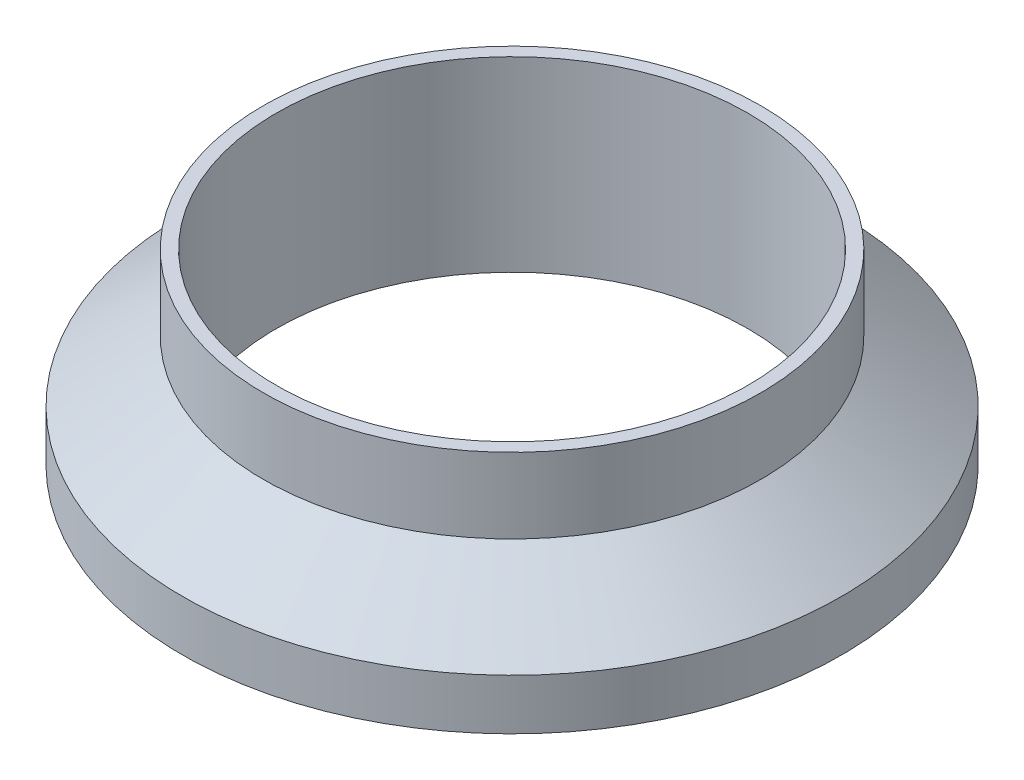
from build123d import *


with BuildPart() as part:
    # Sketch1 → Revolve1 (revolve)
    with BuildSketch(Plane.XY, mode=Mode.PRIVATE) as revolve1_sk:
        with BuildLine():
            Line((-30.099, 0), (-30.099, 23.8252))
            Line((-30.099, 23.8252), (-31.75, 23.8252))
            Line((-31.75, 23.8252), (-31.75, 14.247950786))
            Line((-31.75, 14.247950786), (-42.0624, 6.477))
            Line((-42.0624, 6.477), (-42.0624, 0))
            Line((-42.0624, 0), (-37.977016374, 0))
            ThreePointArc((-37.977016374, 0), (-36.449, 1.1938), (-34.920983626, 0))
            Line((-34.920983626, 0), (-30.099, 0))
        make_face()
    revolve(revolve1_sk.sketch.rotate(Axis((0, 0, 0), (0, 1, 0)), 270), axis=Axis((0, 0, 0), (0, 1, 0)))


solid = part.part
